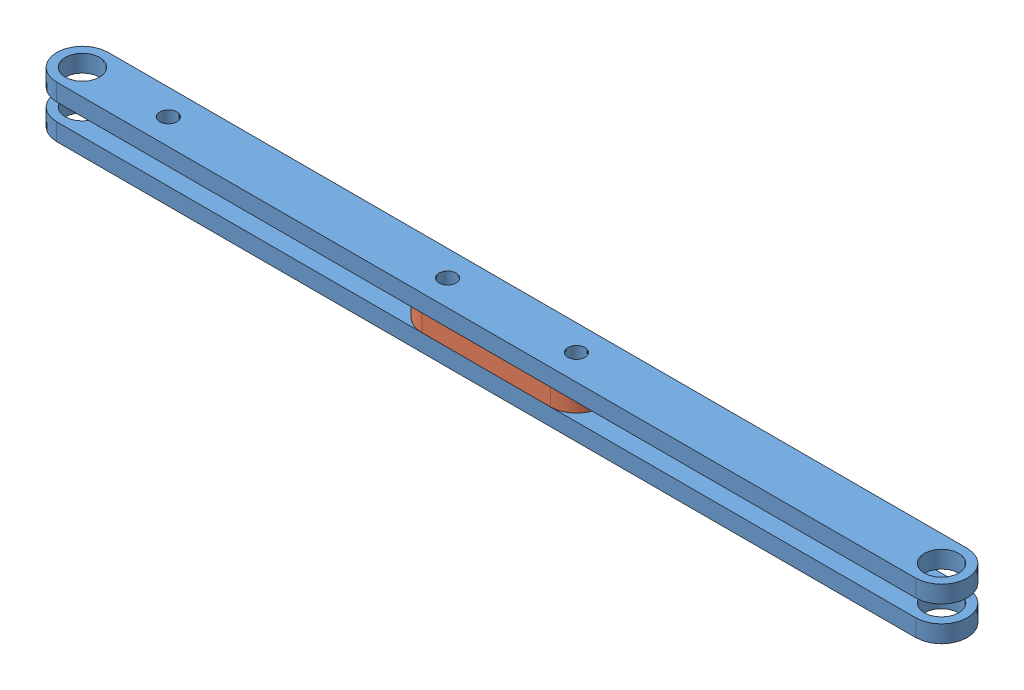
SolidWorks assembly Gripper2 link.SLDASM, configuration Default (file format 3800). Lengths in mm.
Overall size (106 6 6).
3 component instances, 2 part files, 6 mates.
Components (placement in the parent):
- Gripper2 link-1: Gripper2 link.SLDPRT [Default] at (-7.8934 -7.1509 9.0234) size (106 2 6)
- Gripper spacer-1: Gripper spacer.SLDPRT [Default] at (-7.8934 -5.1509 9.0234) size (21 2 6)
- Gripper2 link-2: Gripper2 link.SLDPRT [Default] at (-7.8934 -3.1509 9.0234) size (106 2 6)
Mates (geometry in assembly coordinates):
- Concentric1: concentric: circle of Gripper2 link-1; circle of Gripper spacer-1
- Coincident2: coincident: plane of Gripper2 link-1 through (-57.8934 -5.1509 9.0234) normal (0 1 0); plane of Gripper spacer-1 through (-15.3934 -5.1509 9.0234) normal (0 -1 0)
- Concentric2: concentric aligned: circle of Gripper2 link-1; circle of Gripper spacer-1
- Concentric3: concentric: circle of Gripper spacer-1; circle of ?
- Coincident5: coincident: plane of Gripper spacer-1 through (-15.3934 -3.1509 9.0234) normal (0 1 0); plane of ? through (-51.024 -3.1509 -14.1435) normal (0 -1 0)
- Concentric4: concentric aligned: cylinder of Gripper spacer-1; cylinder of ?
